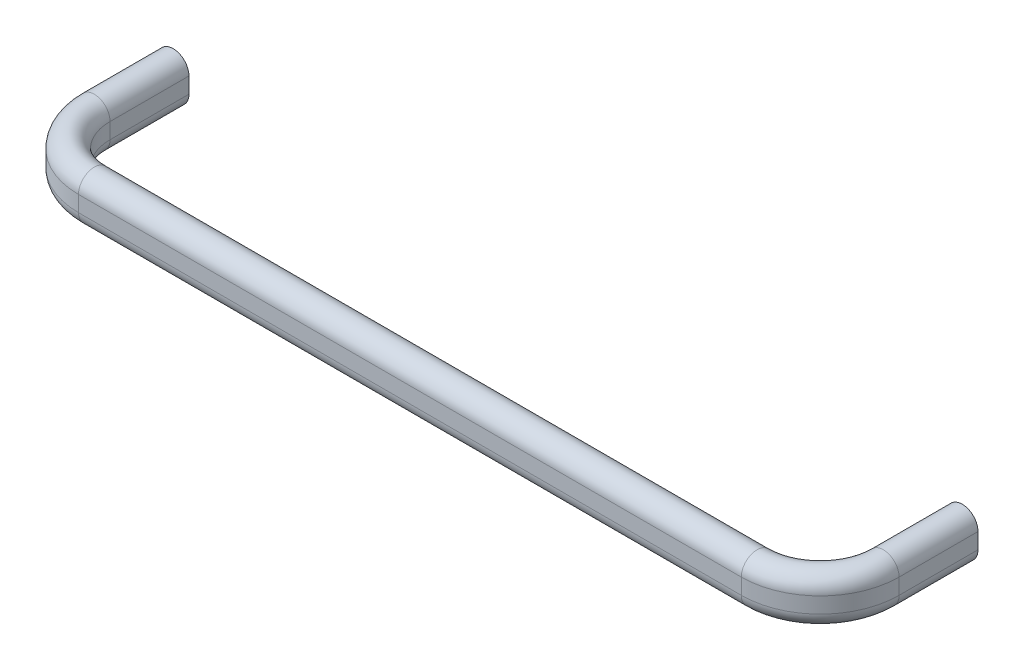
ISO-10303-21;
HEADER;
FILE_DESCRIPTION(('STEP AP214'),'2;1');
FILE_NAME('part.step','',(''),(''),'','','');
FILE_SCHEMA(('AUTOMOTIVE_DESIGN { 1 0 10303 214 1 1 1 1 }'));
ENDSEC;
DATA;
#1=APPLICATION_CONTEXT('core data for automotive mechanical design processes');
#2=APPLICATION_PROTOCOL_DEFINITION('international standard','automotive_design',2000,#1);
#3=PRODUCT_CONTEXT('',#1,'mechanical');
#4=PRODUCT('Part','Part','',(#3));
#5=PRODUCT_RELATED_PRODUCT_CATEGORY('part','',(#4));
#6=PRODUCT_DEFINITION_FORMATION('','',#4);
#7=PRODUCT_DEFINITION_CONTEXT('part definition',#1,'design');
#8=PRODUCT_DEFINITION('design','',#6,#7);
#9=PRODUCT_DEFINITION_SHAPE('','',#8);
#10=(LENGTH_UNIT() NAMED_UNIT(*) SI_UNIT(.MILLI.,.METRE.));
#11=(NAMED_UNIT(*) PLANE_ANGLE_UNIT() SI_UNIT($,.RADIAN.));
#12=(NAMED_UNIT(*) SI_UNIT($,.STERADIAN.) SOLID_ANGLE_UNIT());
#13=UNCERTAINTY_MEASURE_WITH_UNIT(LENGTH_MEASURE(1.E-05),#10,'distance_accuracy_value','');
#14=(GEOMETRIC_REPRESENTATION_CONTEXT(3) GLOBAL_UNCERTAINTY_ASSIGNED_CONTEXT((#13)) GLOBAL_UNIT_ASSIGNED_CONTEXT((#10,
#11,#12)) REPRESENTATION_CONTEXT('',''));
#15=CARTESIAN_POINT('',(0.,0.,0.));
#16=DIRECTION('',(0.,0.,1.));
#17=DIRECTION('',(1.,0.,0.));
#18=AXIS2_PLACEMENT_3D('',#15,#16,#17);
#19=CARTESIAN_POINT('',(0.,2.00000000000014,0.));
#20=DIRECTION('',(0.,0.,-1.));
#21=DIRECTION('',(0.,1.,0.));
#22=AXIS2_PLACEMENT_3D('',#19,#20,#21);
#23=PLANE('',#22);
#24=CARTESIAN_POINT('',(0.,2.00000000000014,0.));
#25=DIRECTION('',(0.,0.,-1.));
#26=DIRECTION('',(0.,1.,0.));
#27=AXIS2_PLACEMENT_3D('',#24,#25,#26);
#28=CIRCLE('',#27,4.);
#29=CARTESIAN_POINT('',(-4.,2.00000000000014,0.));
#30=VERTEX_POINT('',#29);
#31=CARTESIAN_POINT('',(4.,2.00000000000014,0.));
#32=VERTEX_POINT('',#31);
#33=EDGE_CURVE('E31',#30,#32,#28,.T.);
#34=ORIENTED_EDGE('',*,*,#33,.T.);
#35=DIRECTION('',(0.,-1.,0.));
#36=VECTOR('',#35,1.);
#37=CARTESIAN_POINT('',(4.,2.00000000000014,0.));
#38=LINE('',#37,#36);
#39=CARTESIAN_POINT('',(4.,-2.00000000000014,0.));
#40=VERTEX_POINT('',#39);
#41=EDGE_CURVE('E18',#32,#40,#38,.T.);
#42=ORIENTED_EDGE('',*,*,#41,.T.);
#43=CARTESIAN_POINT('',(0.,-2.00000000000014,0.));
#44=DIRECTION('',(0.,0.,-1.));
#45=DIRECTION('',(0.,1.,0.));
#46=AXIS2_PLACEMENT_3D('',#43,#44,#45);
#47=CIRCLE('',#46,3.9999999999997);
#48=CARTESIAN_POINT('',(-4.,-2.00000000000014,0.));
#49=VERTEX_POINT('',#48);
#50=EDGE_CURVE('E39',#40,#49,#47,.T.);
#51=ORIENTED_EDGE('',*,*,#50,.T.);
#52=DIRECTION('',(0.,-1.,0.));
#53=VECTOR('',#52,1.);
#54=CARTESIAN_POINT('',(-4.,2.00000000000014,0.));
#55=LINE('',#54,#53);
#56=EDGE_CURVE('E230',#30,#49,#55,.T.);
#57=ORIENTED_EDGE('',*,*,#56,.F.);
#58=EDGE_LOOP('',(#34,#42,#51,#57));
#59=FACE_BOUND('',#58,.T.);
#60=CARTESIAN_POINT('',(0.,0.,-2.42617341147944E-13));
#61=DIRECTION('',(0.,0.,-1.));
#62=DIRECTION('',(0.,1.,0.));
#63=AXIS2_PLACEMENT_3D('',#60,#61,#62);
#64=CIRCLE('',#63,2.96700000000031);
#65=CARTESIAN_POINT('',(0.,2.96700000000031,-2.42617341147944E-13));
#66=VERTEX_POINT('',#65);
#67=EDGE_CURVE('E542',#66,#66,#64,.T.);
#68=ORIENTED_EDGE('',*,*,#67,.F.);
#69=EDGE_LOOP('',(#68));
#70=FACE_BOUND('',#69,.T.);
#71=ADVANCED_FACE('F14',(#59,#70),#23,.T.);
#72=CARTESIAN_POINT('',(200.,2.00000000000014,0.));
#73=DIRECTION('',(0.,0.,1.));
#74=DIRECTION('',(0.,1.,0.));
#75=AXIS2_PLACEMENT_3D('',#72,#73,#74);
#76=PLANE('',#75);
#77=CARTESIAN_POINT('',(200.,2.00000000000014,0.));
#78=DIRECTION('',(0.,0.,1.));
#79=DIRECTION('',(0.,1.,0.));
#80=AXIS2_PLACEMENT_3D('',#77,#78,#79);
#81=CIRCLE('',#80,4.);
#82=CARTESIAN_POINT('',(204.,2.00000000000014,0.));
#83=VERTEX_POINT('',#82);
#84=CARTESIAN_POINT('',(196.,2.00000000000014,0.));
#85=VERTEX_POINT('',#84);
#86=EDGE_CURVE('E107',#83,#85,#81,.T.);
#87=ORIENTED_EDGE('',*,*,#86,.F.);
#88=DIRECTION('',(0.,-1.,0.));
#89=VECTOR('',#88,1.);
#90=CARTESIAN_POINT('',(204.,2.00000000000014,0.));
#91=LINE('',#90,#89);
#92=CARTESIAN_POINT('',(204.,-2.00000000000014,0.));
#93=VERTEX_POINT('',#92);
#94=EDGE_CURVE('E136',#83,#93,#91,.T.);
#95=ORIENTED_EDGE('',*,*,#94,.T.);
#96=CARTESIAN_POINT('',(200.,-2.00000000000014,0.));
#97=DIRECTION('',(0.,0.,1.));
#98=DIRECTION('',(0.,1.,0.));
#99=AXIS2_PLACEMENT_3D('',#96,#97,#98);
#100=CIRCLE('',#99,3.9999999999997);
#101=CARTESIAN_POINT('',(196.,-2.00000000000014,0.));
#102=VERTEX_POINT('',#101);
#103=EDGE_CURVE('E134',#102,#93,#100,.T.);
#104=ORIENTED_EDGE('',*,*,#103,.F.);
#105=DIRECTION('',(0.,-1.,0.));
#106=VECTOR('',#105,1.);
#107=CARTESIAN_POINT('',(196.,2.00000000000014,0.));
#108=LINE('',#107,#106);
#109=EDGE_CURVE('E119',#85,#102,#108,.T.);
#110=ORIENTED_EDGE('',*,*,#109,.F.);
#111=EDGE_LOOP('',(#87,#95,#104,#110));
#112=FACE_BOUND('',#111,.T.);
#113=CARTESIAN_POINT('',(200.,0.,-2.42617341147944E-13));
#114=DIRECTION('',(0.,0.,1.));
#115=DIRECTION('',(0.,1.,0.));
#116=AXIS2_PLACEMENT_3D('',#113,#114,#115);
#117=CIRCLE('',#116,2.96700000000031);
#118=CARTESIAN_POINT('',(200.,2.96700000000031,-2.42617341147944E-13));
#119=VERTEX_POINT('',#118);
#120=EDGE_CURVE('E120',#119,#119,#117,.T.);
#121=ORIENTED_EDGE('',*,*,#120,.T.);
#122=EDGE_LOOP('',(#121));
#123=FACE_BOUND('',#122,.T.);
#124=ADVANCED_FACE('F132',(#112,#123),#76,.F.);
#125=CARTESIAN_POINT('',(4.,2.00000000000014,20.));
#126=DIRECTION('',(1.,0.,0.));
#127=DIRECTION('',(0.,1.,0.));
#128=AXIS2_PLACEMENT_3D('',#125,#126,#127);
#129=PLANE('',#128);
#130=DIRECTION('',(0.,-1.,0.));
#131=VECTOR('',#130,1.);
#132=CARTESIAN_POINT('',(4.,2.00000000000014,20.));
#133=LINE('',#132,#131);
#134=CARTESIAN_POINT('',(4.,2.00000000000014,20.));
#135=VERTEX_POINT('',#134);
#136=CARTESIAN_POINT('',(4.,-2.00000000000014,20.));
#137=VERTEX_POINT('',#136);
#138=EDGE_CURVE('E204',#135,#137,#133,.T.);
#139=ORIENTED_EDGE('',*,*,#138,.T.);
#140=DIRECTION('',(0.,0.,-1.));
#141=VECTOR('',#140,1.);
#142=CARTESIAN_POINT('',(4.,-2.00000000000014,20.));
#143=LINE('',#142,#141);
#144=EDGE_CURVE('E23',#137,#40,#143,.T.);
#145=ORIENTED_EDGE('',*,*,#144,.T.);
#146=ORIENTED_EDGE('',*,*,#41,.F.);
#147=DIRECTION('',(0.,0.,-1.));
#148=VECTOR('',#147,1.);
#149=CARTESIAN_POINT('',(4.,2.00000000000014,20.));
#150=LINE('',#149,#148);
#151=EDGE_CURVE('E9',#135,#32,#150,.T.);
#152=ORIENTED_EDGE('',*,*,#151,.F.);
#153=EDGE_LOOP('',(#139,#145,#146,#152));
#154=FACE_BOUND('',#153,.T.);
#155=ADVANCED_FACE('F16',(#154),#129,.T.);
#156=CARTESIAN_POINT('',(0.,-2.00000000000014,20.));
#157=DIRECTION('',(0.,0.,-1.));
#158=DIRECTION('',(0.,-1.,0.));
#159=AXIS2_PLACEMENT_3D('',#156,#157,#158);
#160=CYLINDRICAL_SURFACE('',#159,3.9999999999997);
#161=CARTESIAN_POINT('',(0.,-2.00000000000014,20.));
#162=DIRECTION('',(0.,0.,-1.));
#163=DIRECTION('',(0.,1.,0.));
#164=AXIS2_PLACEMENT_3D('',#161,#162,#163);
#165=CIRCLE('',#164,3.9999999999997);
#166=CARTESIAN_POINT('',(-4.,-2.00000000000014,20.));
#167=VERTEX_POINT('',#166);
#168=EDGE_CURVE('E217',#137,#167,#165,.T.);
#169=ORIENTED_EDGE('',*,*,#168,.T.);
#170=DIRECTION('',(0.,0.,-1.));
#171=VECTOR('',#170,1.);
#172=CARTESIAN_POINT('',(-4.,-2.00000000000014,20.));
#173=LINE('',#172,#171);
#174=EDGE_CURVE('E225',#167,#49,#173,.T.);
#175=ORIENTED_EDGE('',*,*,#174,.T.);
#176=ORIENTED_EDGE('',*,*,#50,.F.);
#177=ORIENTED_EDGE('',*,*,#144,.F.);
#178=EDGE_LOOP('',(#169,#175,#176,#177));
#179=FACE_BOUND('',#178,.T.);
#180=ADVANCED_FACE('F235',(#179),#160,.T.);
#181=CARTESIAN_POINT('',(-4.,2.00000000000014,20.));
#182=DIRECTION('',(1.,0.,0.));
#183=DIRECTION('',(0.,1.,0.));
#184=AXIS2_PLACEMENT_3D('',#181,#182,#183);
#185=PLANE('',#184);
#186=DIRECTION('',(0.,-1.,0.));
#187=VECTOR('',#186,1.);
#188=CARTESIAN_POINT('',(-4.,2.00000000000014,20.));
#189=LINE('',#188,#187);
#190=CARTESIAN_POINT('',(-4.,2.00000000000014,20.));
#191=VERTEX_POINT('',#190);
#192=EDGE_CURVE('E214',#191,#167,#189,.T.);
#193=ORIENTED_EDGE('',*,*,#192,.F.);
#194=DIRECTION('',(0.,0.,-1.));
#195=VECTOR('',#194,1.);
#196=CARTESIAN_POINT('',(-4.,2.00000000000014,20.));
#197=LINE('',#196,#195);
#198=EDGE_CURVE('E222',#191,#30,#197,.T.);
#199=ORIENTED_EDGE('',*,*,#198,.T.);
#200=ORIENTED_EDGE('',*,*,#56,.T.);
#201=ORIENTED_EDGE('',*,*,#174,.F.);
#202=EDGE_LOOP('',(#193,#199,#200,#201));
#203=FACE_BOUND('',#202,.T.);
#204=ADVANCED_FACE('F292',(#203),#185,.F.);
#205=CARTESIAN_POINT('',(0.,2.00000000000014,20.));
#206=DIRECTION('',(0.,0.,-1.));
#207=DIRECTION('',(0.,-1.,0.));
#208=AXIS2_PLACEMENT_3D('',#205,#206,#207);
#209=CYLINDRICAL_SURFACE('',#208,4.);
#210=CARTESIAN_POINT('',(0.,2.00000000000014,20.));
#211=DIRECTION('',(0.,0.,-1.));
#212=DIRECTION('',(0.,1.,0.));
#213=AXIS2_PLACEMENT_3D('',#210,#211,#212);
#214=CIRCLE('',#213,4.);
#215=EDGE_CURVE('E190',#191,#135,#214,.T.);
#216=ORIENTED_EDGE('',*,*,#215,.T.);
#217=ORIENTED_EDGE('',*,*,#151,.T.);
#218=ORIENTED_EDGE('',*,*,#33,.F.);
#219=ORIENTED_EDGE('',*,*,#198,.F.);
#220=EDGE_LOOP('',(#216,#217,#218,#219));
#221=FACE_BOUND('',#220,.T.);
#222=ADVANCED_FACE('F283',(#221),#209,.T.);
#223=CARTESIAN_POINT('',(16.,0.,20.));
#224=DIRECTION('',(0.,-1.,0.));
#225=DIRECTION('',(1.,0.,0.));
#226=AXIS2_PLACEMENT_3D('',#223,#224,#225);
#227=CYLINDRICAL_SURFACE('',#226,12.0000000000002);
#228=DIRECTION('',(0.,-1.,0.));
#229=VECTOR('',#228,1.);
#230=CARTESIAN_POINT('',(16.,2.00000000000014,32.));
#231=LINE('',#230,#229);
#232=CARTESIAN_POINT('',(16.,2.00000000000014,32.));
#233=VERTEX_POINT('',#232);
#234=CARTESIAN_POINT('',(16.,-2.00000000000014,32.));
#235=VERTEX_POINT('',#234);
#236=EDGE_CURVE('E181',#233,#235,#231,.T.);
#237=ORIENTED_EDGE('',*,*,#236,.T.);
#238=CARTESIAN_POINT('',(16.,-2.00000000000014,20.));
#239=DIRECTION('',(0.,-1.,0.));
#240=DIRECTION('',(1.,0.,0.));
#241=AXIS2_PLACEMENT_3D('',#238,#239,#240);
#242=CIRCLE('',#241,12.0000000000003);
#243=EDGE_CURVE('E207',#235,#137,#242,.T.);
#244=ORIENTED_EDGE('',*,*,#243,.T.);
#245=ORIENTED_EDGE('',*,*,#138,.F.);
#246=CARTESIAN_POINT('',(16.,2.00000000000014,20.));
#247=DIRECTION('',(0.,-1.,0.));
#248=DIRECTION('',(1.,0.,0.));
#249=AXIS2_PLACEMENT_3D('',#246,#247,#248);
#250=CIRCLE('',#249,12.);
#251=EDGE_CURVE('E210',#233,#135,#250,.T.);
#252=ORIENTED_EDGE('',*,*,#251,.F.);
#253=EDGE_LOOP('',(#237,#244,#245,#252));
#254=FACE_BOUND('',#253,.T.);
#255=ADVANCED_FACE('F281',(#254),#227,.F.);
#256=CARTESIAN_POINT('',(16.,-2.00000000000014,20.));
#257=DIRECTION('',(0.,-1.,0.));
#258=DIRECTION('',(1.,0.,0.));
#259=AXIS2_PLACEMENT_3D('',#256,#257,#258);
#260=TOROIDAL_SURFACE('',#259,16.,3.9999999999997);
#261=CARTESIAN_POINT('',(16.,-2.00000000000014,36.));
#262=DIRECTION('',(-1.,0.,0.));
#263=DIRECTION('',(0.,1.,0.));
#264=AXIS2_PLACEMENT_3D('',#261,#262,#263);
#265=CIRCLE('',#264,3.9999999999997);
#266=CARTESIAN_POINT('',(16.,-2.00000000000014,40.));
#267=VERTEX_POINT('',#266);
#268=EDGE_CURVE('E195',#235,#267,#265,.T.);
#269=ORIENTED_EDGE('',*,*,#268,.T.);
#270=CARTESIAN_POINT('',(16.,-2.00000000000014,20.));
#271=DIRECTION('',(0.,-1.,0.));
#272=DIRECTION('',(1.,0.,0.));
#273=AXIS2_PLACEMENT_3D('',#270,#271,#272);
#274=CIRCLE('',#273,19.9999999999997);
#275=EDGE_CURVE('E203',#267,#167,#274,.T.);
#276=ORIENTED_EDGE('',*,*,#275,.T.);
#277=ORIENTED_EDGE('',*,*,#168,.F.);
#278=ORIENTED_EDGE('',*,*,#243,.F.);
#279=EDGE_LOOP('',(#269,#276,#277,#278));
#280=FACE_BOUND('',#279,.T.);
#281=ADVANCED_FACE('F244',(#280),#260,.T.);
#282=CARTESIAN_POINT('',(16.,0.,20.));
#283=DIRECTION('',(0.,-1.,0.));
#284=DIRECTION('',(1.,0.,0.));
#285=AXIS2_PLACEMENT_3D('',#282,#283,#284);
#286=CYLINDRICAL_SURFACE('',#285,20.);
#287=DIRECTION('',(0.,-1.,0.));
#288=VECTOR('',#287,1.);
#289=CARTESIAN_POINT('',(16.,2.00000000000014,40.));
#290=LINE('',#289,#288);
#291=CARTESIAN_POINT('',(16.,2.00000000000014,40.));
#292=VERTEX_POINT('',#291);
#293=EDGE_CURVE('E192',#292,#267,#290,.T.);
#294=ORIENTED_EDGE('',*,*,#293,.F.);
#295=CARTESIAN_POINT('',(16.,2.00000000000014,20.));
#296=DIRECTION('',(0.,-1.,0.));
#297=DIRECTION('',(1.,0.,0.));
#298=AXIS2_PLACEMENT_3D('',#295,#296,#297);
#299=CIRCLE('',#298,20.);
#300=EDGE_CURVE('E200',#292,#191,#299,.T.);
#301=ORIENTED_EDGE('',*,*,#300,.T.);
#302=ORIENTED_EDGE('',*,*,#192,.T.);
#303=ORIENTED_EDGE('',*,*,#275,.F.);
#304=EDGE_LOOP('',(#294,#301,#302,#303));
#305=FACE_BOUND('',#304,.T.);
#306=ADVANCED_FACE('F241',(#305),#286,.T.);
#307=CARTESIAN_POINT('',(16.,2.00000000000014,20.));
#308=DIRECTION('',(0.,-1.,0.));
#309=DIRECTION('',(1.,0.,0.));
#310=AXIS2_PLACEMENT_3D('',#307,#308,#309);
#311=TOROIDAL_SURFACE('',#310,16.,4.);
#312=CARTESIAN_POINT('',(16.,2.00000000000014,36.));
#313=DIRECTION('',(-1.,0.,0.));
#314=DIRECTION('',(0.,1.,0.));
#315=AXIS2_PLACEMENT_3D('',#312,#313,#314);
#316=CIRCLE('',#315,4.);
#317=EDGE_CURVE('E167',#292,#233,#316,.T.);
#318=ORIENTED_EDGE('',*,*,#317,.T.);
#319=ORIENTED_EDGE('',*,*,#251,.T.);
#320=ORIENTED_EDGE('',*,*,#215,.F.);
#321=ORIENTED_EDGE('',*,*,#300,.F.);
#322=EDGE_LOOP('',(#318,#319,#320,#321));
#323=FACE_BOUND('',#322,.T.);
#324=ADVANCED_FACE('F279',(#323),#311,.T.);
#325=CARTESIAN_POINT('',(184.,2.00000000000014,32.));
#326=DIRECTION('',(0.,0.,-1.));
#327=DIRECTION('',(0.,-1.,0.));
#328=AXIS2_PLACEMENT_3D('',#325,#326,#327);
#329=PLANE('',#328);
#330=DIRECTION('',(0.,-1.,0.));
#331=VECTOR('',#330,1.);
#332=CARTESIAN_POINT('',(184.,2.00000000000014,32.));
#333=LINE('',#332,#331);
#334=CARTESIAN_POINT('',(184.,2.00000000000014,32.));
#335=VERTEX_POINT('',#334);
#336=CARTESIAN_POINT('',(184.,-2.00000000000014,32.));
#337=VERTEX_POINT('',#336);
#338=EDGE_CURVE('E158',#335,#337,#333,.T.);
#339=ORIENTED_EDGE('',*,*,#338,.T.);
#340=DIRECTION('',(-1.,0.,0.));
#341=VECTOR('',#340,1.);
#342=CARTESIAN_POINT('',(184.,-2.00000000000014,32.));
#343=LINE('',#342,#341);
#344=EDGE_CURVE('E184',#337,#235,#343,.T.);
#345=ORIENTED_EDGE('',*,*,#344,.T.);
#346=ORIENTED_EDGE('',*,*,#236,.F.);
#347=DIRECTION('',(-1.,0.,0.));
#348=VECTOR('',#347,1.);
#349=CARTESIAN_POINT('',(184.,2.00000000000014,32.));
#350=LINE('',#349,#348);
#351=EDGE_CURVE('E187',#335,#233,#350,.T.);
#352=ORIENTED_EDGE('',*,*,#351,.F.);
#353=EDGE_LOOP('',(#339,#345,#346,#352));
#354=FACE_BOUND('',#353,.T.);
#355=ADVANCED_FACE('F273',(#354),#329,.T.);
#356=CARTESIAN_POINT('',(184.,-2.00000000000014,36.));
#357=DIRECTION('',(-1.,0.,0.));
#358=DIRECTION('',(0.,0.,1.));
#359=AXIS2_PLACEMENT_3D('',#356,#357,#358);
#360=CYLINDRICAL_SURFACE('',#359,3.9999999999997);
#361=CARTESIAN_POINT('',(184.,-2.00000000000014,36.));
#362=DIRECTION('',(-1.,0.,0.));
#363=DIRECTION('',(0.,1.,0.));
#364=AXIS2_PLACEMENT_3D('',#361,#362,#363);
#365=CIRCLE('',#364,3.9999999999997);
#366=CARTESIAN_POINT('',(184.,-2.00000000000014,40.));
#367=VERTEX_POINT('',#366);
#368=EDGE_CURVE('E172',#337,#367,#365,.T.);
#369=ORIENTED_EDGE('',*,*,#368,.T.);
#370=DIRECTION('',(-1.,0.,0.));
#371=VECTOR('',#370,1.);
#372=CARTESIAN_POINT('',(184.,-2.00000000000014,40.));
#373=LINE('',#372,#371);
#374=EDGE_CURVE('E180',#367,#267,#373,.T.);
#375=ORIENTED_EDGE('',*,*,#374,.T.);
#376=ORIENTED_EDGE('',*,*,#268,.F.);
#377=ORIENTED_EDGE('',*,*,#344,.F.);
#378=EDGE_LOOP('',(#369,#375,#376,#377));
#379=FACE_BOUND('',#378,.T.);
#380=ADVANCED_FACE('F251',(#379),#360,.T.);
#381=CARTESIAN_POINT('',(184.,2.00000000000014,40.));
#382=DIRECTION('',(0.,0.,-1.));
#383=DIRECTION('',(0.,-1.,0.));
#384=AXIS2_PLACEMENT_3D('',#381,#382,#383);
#385=PLANE('',#384);
#386=DIRECTION('',(0.,-1.,0.));
#387=VECTOR('',#386,1.);
#388=CARTESIAN_POINT('',(184.,2.00000000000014,40.));
#389=LINE('',#388,#387);
#390=CARTESIAN_POINT('',(184.,2.00000000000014,40.));
#391=VERTEX_POINT('',#390);
#392=EDGE_CURVE('E169',#391,#367,#389,.T.);
#393=ORIENTED_EDGE('',*,*,#392,.F.);
#394=DIRECTION('',(-1.,0.,0.));
#395=VECTOR('',#394,1.);
#396=CARTESIAN_POINT('',(184.,2.00000000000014,40.));
#397=LINE('',#396,#395);
#398=EDGE_CURVE('E177',#391,#292,#397,.T.);
#399=ORIENTED_EDGE('',*,*,#398,.T.);
#400=ORIENTED_EDGE('',*,*,#293,.T.);
#401=ORIENTED_EDGE('',*,*,#374,.F.);
#402=EDGE_LOOP('',(#393,#399,#400,#401));
#403=FACE_BOUND('',#402,.T.);
#404=ADVANCED_FACE('F249',(#403),#385,.F.);
#405=CARTESIAN_POINT('',(184.,2.00000000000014,36.));
#406=DIRECTION('',(-1.,0.,0.));
#407=DIRECTION('',(0.,0.,1.));
#408=AXIS2_PLACEMENT_3D('',#405,#406,#407);
#409=CYLINDRICAL_SURFACE('',#408,4.);
#410=CARTESIAN_POINT('',(184.,2.00000000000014,36.));
#411=DIRECTION('',(-1.,0.,0.));
#412=DIRECTION('',(0.,1.,0.));
#413=AXIS2_PLACEMENT_3D('',#410,#411,#412);
#414=CIRCLE('',#413,4.);
#415=EDGE_CURVE('E129',#391,#335,#414,.T.);
#416=ORIENTED_EDGE('',*,*,#415,.T.);
#417=ORIENTED_EDGE('',*,*,#351,.T.);
#418=ORIENTED_EDGE('',*,*,#317,.F.);
#419=ORIENTED_EDGE('',*,*,#398,.F.);
#420=EDGE_LOOP('',(#416,#417,#418,#419));
#421=FACE_BOUND('',#420,.T.);
#422=ADVANCED_FACE('F276',(#421),#409,.T.);
#423=CARTESIAN_POINT('',(184.,0.,20.));
#424=DIRECTION('',(0.,-1.,0.));
#425=DIRECTION('',(1.,0.,0.));
#426=AXIS2_PLACEMENT_3D('',#423,#424,#425);
#427=CYLINDRICAL_SURFACE('',#426,12.0000000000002);
#428=DIRECTION('',(0.,-1.,0.));
#429=VECTOR('',#428,1.);
#430=CARTESIAN_POINT('',(196.,2.00000000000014,20.));
#431=LINE('',#430,#429);
#432=CARTESIAN_POINT('',(196.,2.00000000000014,20.));
#433=VERTEX_POINT('',#432);
#434=CARTESIAN_POINT('',(196.,-2.00000000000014,20.));
#435=VERTEX_POINT('',#434);
#436=EDGE_CURVE('E128',#433,#435,#431,.T.);
#437=ORIENTED_EDGE('',*,*,#436,.T.);
#438=CARTESIAN_POINT('',(184.,-2.00000000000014,20.));
#439=DIRECTION('',(0.,-1.,0.));
#440=DIRECTION('',(1.,0.,0.));
#441=AXIS2_PLACEMENT_3D('',#438,#439,#440);
#442=CIRCLE('',#441,12.0000000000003);
#443=EDGE_CURVE('E161',#435,#337,#442,.T.);
#444=ORIENTED_EDGE('',*,*,#443,.T.);
#445=ORIENTED_EDGE('',*,*,#338,.F.);
#446=CARTESIAN_POINT('',(184.,2.00000000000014,20.));
#447=DIRECTION('',(0.,-1.,0.));
#448=DIRECTION('',(1.,0.,0.));
#449=AXIS2_PLACEMENT_3D('',#446,#447,#448);
#450=CIRCLE('',#449,12.);
#451=EDGE_CURVE('E164',#433,#335,#450,.T.);
#452=ORIENTED_EDGE('',*,*,#451,.F.);
#453=EDGE_LOOP('',(#437,#444,#445,#452));
#454=FACE_BOUND('',#453,.T.);
#455=ADVANCED_FACE('F270',(#454),#427,.F.);
#456=CARTESIAN_POINT('',(184.,-2.00000000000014,20.));
#457=DIRECTION('',(0.,-1.,0.));
#458=DIRECTION('',(1.,0.,0.));
#459=AXIS2_PLACEMENT_3D('',#456,#457,#458);
#460=TOROIDAL_SURFACE('',#459,16.,3.9999999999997);
#461=CARTESIAN_POINT('',(200.,-2.00000000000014,20.));
#462=DIRECTION('',(0.,0.,1.));
#463=DIRECTION('',(0.,1.,0.));
#464=AXIS2_PLACEMENT_3D('',#461,#462,#463);
#465=CIRCLE('',#464,3.9999999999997);
#466=CARTESIAN_POINT('',(204.,-2.00000000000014,20.));
#467=VERTEX_POINT('',#466);
#468=EDGE_CURVE('E144',#435,#467,#465,.T.);
#469=ORIENTED_EDGE('',*,*,#468,.T.);
#470=CARTESIAN_POINT('',(184.,-2.00000000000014,20.));
#471=DIRECTION('',(0.,-1.,0.));
#472=DIRECTION('',(1.,0.,0.));
#473=AXIS2_PLACEMENT_3D('',#470,#471,#472);
#474=CIRCLE('',#473,19.9999999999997);
#475=EDGE_CURVE('E157',#467,#367,#474,.T.);
#476=ORIENTED_EDGE('',*,*,#475,.T.);
#477=ORIENTED_EDGE('',*,*,#368,.F.);
#478=ORIENTED_EDGE('',*,*,#443,.F.);
#479=EDGE_LOOP('',(#469,#476,#477,#478));
#480=FACE_BOUND('',#479,.T.);
#481=ADVANCED_FACE('F259',(#480),#460,.T.);
#482=CARTESIAN_POINT('',(184.,0.,20.));
#483=DIRECTION('',(0.,-1.,0.));
#484=DIRECTION('',(1.,0.,0.));
#485=AXIS2_PLACEMENT_3D('',#482,#483,#484);
#486=CYLINDRICAL_SURFACE('',#485,20.);
#487=DIRECTION('',(0.,-1.,0.));
#488=VECTOR('',#487,1.);
#489=CARTESIAN_POINT('',(204.,2.00000000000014,20.));
#490=LINE('',#489,#488);
#491=CARTESIAN_POINT('',(204.,2.00000000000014,20.));
#492=VERTEX_POINT('',#491);
#493=EDGE_CURVE('E146',#492,#467,#490,.T.);
#494=ORIENTED_EDGE('',*,*,#493,.F.);
#495=CARTESIAN_POINT('',(184.,2.00000000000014,20.));
#496=DIRECTION('',(0.,-1.,0.));
#497=DIRECTION('',(1.,0.,0.));
#498=AXIS2_PLACEMENT_3D('',#495,#496,#497);
#499=CIRCLE('',#498,20.);
#500=EDGE_CURVE('E154',#492,#391,#499,.T.);
#501=ORIENTED_EDGE('',*,*,#500,.T.);
#502=ORIENTED_EDGE('',*,*,#392,.T.);
#503=ORIENTED_EDGE('',*,*,#475,.F.);
#504=EDGE_LOOP('',(#494,#501,#502,#503));
#505=FACE_BOUND('',#504,.T.);
#506=ADVANCED_FACE('F256',(#505),#486,.T.);
#507=CARTESIAN_POINT('',(184.,2.00000000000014,20.));
#508=DIRECTION('',(0.,-1.,0.));
#509=DIRECTION('',(1.,0.,0.));
#510=AXIS2_PLACEMENT_3D('',#507,#508,#509);
#511=TOROIDAL_SURFACE('',#510,16.,4.);
#512=CARTESIAN_POINT('',(200.,2.00000000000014,20.));
#513=DIRECTION('',(0.,0.,1.));
#514=DIRECTION('',(0.,1.,0.));
#515=AXIS2_PLACEMENT_3D('',#512,#513,#514);
#516=CIRCLE('',#515,4.);
#517=EDGE_CURVE('E141',#492,#433,#516,.T.);
#518=ORIENTED_EDGE('',*,*,#517,.T.);
#519=ORIENTED_EDGE('',*,*,#451,.T.);
#520=ORIENTED_EDGE('',*,*,#415,.F.);
#521=ORIENTED_EDGE('',*,*,#500,.F.);
#522=EDGE_LOOP('',(#518,#519,#520,#521));
#523=FACE_BOUND('',#522,.T.);
#524=ADVANCED_FACE('F267',(#523),#511,.T.);
#525=CARTESIAN_POINT('',(200.,2.00000000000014,20.));
#526=DIRECTION('',(0.,0.,-1.));
#527=DIRECTION('',(-1.,0.,0.));
#528=AXIS2_PLACEMENT_3D('',#525,#526,#527);
#529=CYLINDRICAL_SURFACE('',#528,4.);
#530=DIRECTION('',(0.,0.,-1.));
#531=VECTOR('',#530,1.);
#532=CARTESIAN_POINT('',(196.,2.00000000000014,20.));
#533=LINE('',#532,#531);
#534=EDGE_CURVE('E111',#433,#85,#533,.T.);
#535=ORIENTED_EDGE('',*,*,#534,.F.);
#536=ORIENTED_EDGE('',*,*,#517,.F.);
#537=DIRECTION('',(0.,0.,-1.));
#538=VECTOR('',#537,1.);
#539=CARTESIAN_POINT('',(204.,2.00000000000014,20.));
#540=LINE('',#539,#538);
#541=EDGE_CURVE('E114',#492,#83,#540,.T.);
#542=ORIENTED_EDGE('',*,*,#541,.T.);
#543=ORIENTED_EDGE('',*,*,#86,.T.);
#544=EDGE_LOOP('',(#535,#536,#542,#543));
#545=FACE_BOUND('',#544,.T.);
#546=ADVANCED_FACE('F109',(#545),#529,.T.);
#547=CARTESIAN_POINT('',(196.,2.00000000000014,20.));
#548=DIRECTION('',(1.,0.,0.));
#549=DIRECTION('',(0.,1.,0.));
#550=AXIS2_PLACEMENT_3D('',#547,#548,#549);
#551=PLANE('',#550);
#552=DIRECTION('',(0.,0.,-1.));
#553=VECTOR('',#552,1.);
#554=CARTESIAN_POINT('',(196.,-2.00000000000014,20.));
#555=LINE('',#554,#553);
#556=EDGE_CURVE('E130',#435,#102,#555,.T.);
#557=ORIENTED_EDGE('',*,*,#556,.F.);
#558=ORIENTED_EDGE('',*,*,#436,.F.);
#559=ORIENTED_EDGE('',*,*,#534,.T.);
#560=ORIENTED_EDGE('',*,*,#109,.T.);
#561=EDGE_LOOP('',(#557,#558,#559,#560));
#562=FACE_BOUND('',#561,.T.);
#563=ADVANCED_FACE('F125',(#562),#551,.F.);
#564=CARTESIAN_POINT('',(200.,-2.00000000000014,20.));
#565=DIRECTION('',(0.,0.,-1.));
#566=DIRECTION('',(-1.,0.,0.));
#567=AXIS2_PLACEMENT_3D('',#564,#565,#566);
#568=CYLINDRICAL_SURFACE('',#567,3.9999999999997);
#569=DIRECTION('',(0.,0.,-1.));
#570=VECTOR('',#569,1.);
#571=CARTESIAN_POINT('',(204.,-2.00000000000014,20.));
#572=LINE('',#571,#570);
#573=EDGE_CURVE('E150',#467,#93,#572,.T.);
#574=ORIENTED_EDGE('',*,*,#573,.F.);
#575=ORIENTED_EDGE('',*,*,#468,.F.);
#576=ORIENTED_EDGE('',*,*,#556,.T.);
#577=ORIENTED_EDGE('',*,*,#103,.T.);
#578=EDGE_LOOP('',(#574,#575,#576,#577));
#579=FACE_BOUND('',#578,.T.);
#580=ADVANCED_FACE('F262',(#579),#568,.T.);
#581=CARTESIAN_POINT('',(204.,2.00000000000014,20.));
#582=DIRECTION('',(1.,0.,0.));
#583=DIRECTION('',(0.,1.,0.));
#584=AXIS2_PLACEMENT_3D('',#581,#582,#583);
#585=PLANE('',#584);
#586=ORIENTED_EDGE('',*,*,#493,.T.);
#587=ORIENTED_EDGE('',*,*,#573,.T.);
#588=ORIENTED_EDGE('',*,*,#94,.F.);
#589=ORIENTED_EDGE('',*,*,#541,.F.);
#590=EDGE_LOOP('',(#586,#587,#588,#589));
#591=FACE_BOUND('',#590,.T.);
#592=ADVANCED_FACE('F264',(#591),#585,.T.);
#593=CARTESIAN_POINT('',(200.,0.,-2.42617341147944E-13));
#594=DIRECTION('',(0.,0.,-1.));
#595=DIRECTION('',(0.,-1.,0.));
#596=AXIS2_PLACEMENT_3D('',#593,#594,#595);
#597=CONICAL_SURFACE('',#596,2.96700000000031,0.785398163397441);
#598=CARTESIAN_POINT('',(200.,0.,0.467000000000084));
#599=DIRECTION('',(0.,0.,-1.));
#600=DIRECTION('',(-1.,0.,0.));
#601=AXIS2_PLACEMENT_3D('',#598,#599,#600);
#602=CIRCLE('',#601,2.5);
#603=CARTESIAN_POINT('',(197.5,0.,0.467000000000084));
#604=VERTEX_POINT('',#603);
#605=EDGE_CURVE('E539',#604,#604,#602,.T.);
#606=ORIENTED_EDGE('',*,*,#605,.F.);
#607=EDGE_LOOP('',(#606));
#608=FACE_BOUND('',#607,.T.);
#609=ORIENTED_EDGE('',*,*,#120,.F.);
#610=EDGE_LOOP('',(#609));
#611=FACE_BOUND('',#610,.T.);
#612=ADVANCED_FACE('F306',(#608,#611),#597,.F.);
#613=CARTESIAN_POINT('',(0.,0.,-2.42617341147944E-13));
#614=DIRECTION('',(0.,0.,-1.));
#615=DIRECTION('',(0.,-1.,0.));
#616=AXIS2_PLACEMENT_3D('',#613,#614,#615);
#617=CONICAL_SURFACE('',#616,2.96700000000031,0.785398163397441);
#618=CARTESIAN_POINT('',(0.,0.,0.467000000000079));
#619=DIRECTION('',(0.,0.,-1.));
#620=DIRECTION('',(-1.,0.,0.));
#621=AXIS2_PLACEMENT_3D('',#618,#619,#620);
#622=CIRCLE('',#621,2.5);
#623=CARTESIAN_POINT('',(-2.5,0.,0.467000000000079));
#624=VERTEX_POINT('',#623);
#625=EDGE_CURVE('E531',#624,#624,#622,.T.);
#626=ORIENTED_EDGE('',*,*,#625,.F.);
#627=EDGE_LOOP('',(#626));
#628=FACE_BOUND('',#627,.T.);
#629=ORIENTED_EDGE('',*,*,#67,.T.);
#630=EDGE_LOOP('',(#629));
#631=FACE_BOUND('',#630,.T.);
#632=ADVANCED_FACE('F414',(#628,#631),#617,.F.);
#633=CARTESIAN_POINT('',(200.,0.,10.));
#634=DIRECTION('',(0.,0.,-1.));
#635=DIRECTION('',(-1.,0.,0.));
#636=AXIS2_PLACEMENT_3D('',#633,#634,#635);
#637=CYLINDRICAL_SURFACE('',#636,2.5);
#638=ORIENTED_EDGE('',*,*,#605,.T.);
#639=EDGE_LOOP('',(#638));
#640=FACE_BOUND('',#639,.T.);
#641=CARTESIAN_POINT('',(200.,0.,10.));
#642=DIRECTION('',(0.,0.,-1.));
#643=DIRECTION('',(-1.,0.,0.));
#644=AXIS2_PLACEMENT_3D('',#641,#642,#643);
#645=CIRCLE('',#644,2.5);
#646=CARTESIAN_POINT('',(197.5,0.,10.));
#647=VERTEX_POINT('',#646);
#648=EDGE_CURVE('E534',#647,#647,#645,.T.);
#649=ORIENTED_EDGE('',*,*,#648,.F.);
#650=EDGE_LOOP('',(#649));
#651=FACE_BOUND('',#650,.T.);
#652=ADVANCED_FACE('F422',(#640,#651),#637,.F.);
#653=CARTESIAN_POINT('',(200.,0.,10.));
#654=DIRECTION('',(0.,0.,-1.));
#655=DIRECTION('',(-1.,0.,0.));
#656=AXIS2_PLACEMENT_3D('',#653,#654,#655);
#657=PLANE('',#656);
#658=ORIENTED_EDGE('',*,*,#648,.T.);
#659=EDGE_LOOP('',(#658));
#660=FACE_BOUND('',#659,.T.);
#661=ADVANCED_FACE('F431',(#660),#657,.T.);
#662=CARTESIAN_POINT('',(0.,0.,10.));
#663=DIRECTION('',(0.,0.,-1.));
#664=DIRECTION('',(-1.,0.,0.));
#665=AXIS2_PLACEMENT_3D('',#662,#663,#664);
#666=CYLINDRICAL_SURFACE('',#665,2.5);
#667=ORIENTED_EDGE('',*,*,#625,.T.);
#668=EDGE_LOOP('',(#667));
#669=FACE_BOUND('',#668,.T.);
#670=CARTESIAN_POINT('',(0.,0.,10.));
#671=DIRECTION('',(0.,0.,-1.));
#672=DIRECTION('',(-1.,0.,0.));
#673=AXIS2_PLACEMENT_3D('',#670,#671,#672);
#674=CIRCLE('',#673,2.5);
#675=CARTESIAN_POINT('',(-2.5,0.,10.));
#676=VERTEX_POINT('',#675);
#677=EDGE_CURVE('E529',#676,#676,#674,.T.);
#678=ORIENTED_EDGE('',*,*,#677,.F.);
#679=EDGE_LOOP('',(#678));
#680=FACE_BOUND('',#679,.T.);
#681=ADVANCED_FACE('F440',(#669,#680),#666,.F.);
#682=CARTESIAN_POINT('',(0.,0.,10.));
#683=DIRECTION('',(0.,0.,-1.));
#684=DIRECTION('',(-1.,0.,0.));
#685=AXIS2_PLACEMENT_3D('',#682,#683,#684);
#686=PLANE('',#685);
#687=ORIENTED_EDGE('',*,*,#677,.T.);
#688=EDGE_LOOP('',(#687));
#689=FACE_BOUND('',#688,.T.);
#690=ADVANCED_FACE('F449',(#689),#686,.T.);
#691=CLOSED_SHELL('',(#71,#124,#155,#180,#204,#222,#255,#281,#306,#324,#355,#380,#404,#422,#455,
#481,#506,#524,#546,#563,#580,#592,#612,#632,#652,#661,#681,#690));
#692=MANIFOLD_SOLID_BREP('B1',#691);
#693=ADVANCED_BREP_SHAPE_REPRESENTATION('',(#18,#692),#14);
#694=SHAPE_DEFINITION_REPRESENTATION(#9,#693);
ENDSEC;
END-ISO-10303-21;
